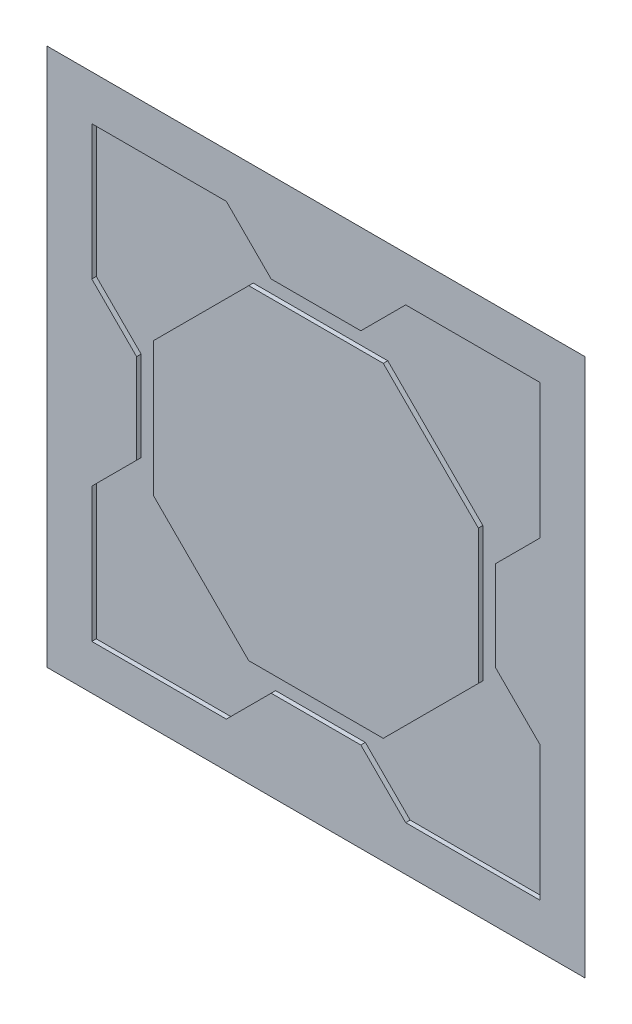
ISO-10303-21;
HEADER;
FILE_DESCRIPTION(('STEP AP214'),'2;1');
FILE_NAME('part.step','',(''),(''),'','','');
FILE_SCHEMA(('AUTOMOTIVE_DESIGN { 1 0 10303 214 1 1 1 1 }'));
ENDSEC;
DATA;
#1=APPLICATION_CONTEXT('core data for automotive mechanical design processes');
#2=APPLICATION_PROTOCOL_DEFINITION('international standard','automotive_design',2000,#1);
#3=PRODUCT_CONTEXT('',#1,'mechanical');
#4=PRODUCT('Part','Part','',(#3));
#5=PRODUCT_RELATED_PRODUCT_CATEGORY('part','',(#4));
#6=PRODUCT_DEFINITION_FORMATION('','',#4);
#7=PRODUCT_DEFINITION_CONTEXT('part definition',#1,'design');
#8=PRODUCT_DEFINITION('design','',#6,#7);
#9=PRODUCT_DEFINITION_SHAPE('','',#8);
#10=(LENGTH_UNIT() NAMED_UNIT(*) SI_UNIT(.MILLI.,.METRE.));
#11=(NAMED_UNIT(*) PLANE_ANGLE_UNIT() SI_UNIT($,.RADIAN.));
#12=(NAMED_UNIT(*) SI_UNIT($,.STERADIAN.) SOLID_ANGLE_UNIT());
#13=UNCERTAINTY_MEASURE_WITH_UNIT(LENGTH_MEASURE(1.E-05),#10,'distance_accuracy_value','');
#14=(GEOMETRIC_REPRESENTATION_CONTEXT(3) GLOBAL_UNCERTAINTY_ASSIGNED_CONTEXT((#13)) GLOBAL_UNIT_ASSIGNED_CONTEXT((#10,
#11,#12)) REPRESENTATION_CONTEXT('',''));
#15=CARTESIAN_POINT('',(0.,0.,0.));
#16=DIRECTION('',(0.,0.,1.));
#17=DIRECTION('',(1.,0.,0.));
#18=AXIS2_PLACEMENT_3D('',#15,#16,#17);
#19=CARTESIAN_POINT('',(0.,0.,10.));
#20=DIRECTION('',(0.,0.,-1.));
#21=DIRECTION('',(-1.,0.,0.));
#22=AXIS2_PLACEMENT_3D('',#19,#20,#21);
#23=PLANE('',#22);
#24=DIRECTION('',(0.707106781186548,-0.707106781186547,0.));
#25=VECTOR('',#24,1.);
#26=CARTESIAN_POINT('',(-50.,20.,10.));
#27=LINE('',#26,#25);
#28=CARTESIAN_POINT('',(-50.,20.,10.));
#29=VERTEX_POINT('',#28);
#30=CARTESIAN_POINT('',(-40.,10.,10.));
#31=VERTEX_POINT('',#30);
#32=EDGE_CURVE('E383',#29,#31,#27,.T.);
#33=ORIENTED_EDGE('',*,*,#32,.F.);
#34=DIRECTION('',(0.,-1.,0.));
#35=VECTOR('',#34,1.);
#36=CARTESIAN_POINT('',(-50.,50.,10.));
#37=LINE('',#36,#35);
#38=CARTESIAN_POINT('',(-50.,50.,10.));
#39=VERTEX_POINT('',#38);
#40=EDGE_CURVE('E308',#39,#29,#37,.T.);
#41=ORIENTED_EDGE('',*,*,#40,.F.);
#42=DIRECTION('',(-1.,0.,0.));
#43=VECTOR('',#42,1.);
#44=CARTESIAN_POINT('',(-50.,50.,10.));
#45=LINE('',#44,#43);
#46=CARTESIAN_POINT('',(-20.,50.,10.));
#47=VERTEX_POINT('',#46);
#48=EDGE_CURVE('E324',#47,#39,#45,.T.);
#49=ORIENTED_EDGE('',*,*,#48,.F.);
#50=DIRECTION('',(-0.707106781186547,0.707106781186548,0.));
#51=VECTOR('',#50,1.);
#52=CARTESIAN_POINT('',(-20.,50.,10.));
#53=LINE('',#52,#51);
#54=CARTESIAN_POINT('',(-10.,40.,10.));
#55=VERTEX_POINT('',#54);
#56=EDGE_CURVE('E434',#55,#47,#53,.T.);
#57=ORIENTED_EDGE('',*,*,#56,.F.);
#58=DIRECTION('',(-1.,0.,0.));
#59=VECTOR('',#58,1.);
#60=CARTESIAN_POINT('',(-10.,40.,10.));
#61=LINE('',#60,#59);
#62=CARTESIAN_POINT('',(9.99999999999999,40.,10.));
#63=VERTEX_POINT('',#62);
#64=EDGE_CURVE('E431',#63,#55,#61,.T.);
#65=ORIENTED_EDGE('',*,*,#64,.F.);
#66=DIRECTION('',(-0.707106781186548,-0.707106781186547,0.));
#67=VECTOR('',#66,1.);
#68=CARTESIAN_POINT('',(9.99999999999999,40.,10.));
#69=LINE('',#68,#67);
#70=CARTESIAN_POINT('',(20.,50.,10.));
#71=VERTEX_POINT('',#70);
#72=EDGE_CURVE('E428',#71,#63,#69,.T.);
#73=ORIENTED_EDGE('',*,*,#72,.F.);
#74=DIRECTION('',(-1.,0.,0.));
#75=VECTOR('',#74,1.);
#76=CARTESIAN_POINT('',(20.,50.,10.));
#77=LINE('',#76,#75);
#78=CARTESIAN_POINT('',(50.,50.,10.));
#79=VERTEX_POINT('',#78);
#80=EDGE_CURVE('E425',#79,#71,#77,.T.);
#81=ORIENTED_EDGE('',*,*,#80,.F.);
#82=DIRECTION('',(0.,1.,0.));
#83=VECTOR('',#82,1.);
#84=CARTESIAN_POINT('',(50.,20.,10.));
#85=LINE('',#84,#83);
#86=CARTESIAN_POINT('',(50.,20.,10.));
#87=VERTEX_POINT('',#86);
#88=EDGE_CURVE('E422',#87,#79,#85,.T.);
#89=ORIENTED_EDGE('',*,*,#88,.F.);
#90=DIRECTION('',(0.707106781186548,0.707106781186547,0.));
#91=VECTOR('',#90,1.);
#92=CARTESIAN_POINT('',(40.,10.,10.));
#93=LINE('',#92,#91);
#94=CARTESIAN_POINT('',(40.,10.,10.));
#95=VERTEX_POINT('',#94);
#96=EDGE_CURVE('E419',#95,#87,#93,.T.);
#97=ORIENTED_EDGE('',*,*,#96,.F.);
#98=DIRECTION('',(0.,1.,0.));
#99=VECTOR('',#98,1.);
#100=CARTESIAN_POINT('',(40.,-10.,10.));
#101=LINE('',#100,#99);
#102=CARTESIAN_POINT('',(40.,-10.,10.));
#103=VERTEX_POINT('',#102);
#104=EDGE_CURVE('E416',#103,#95,#101,.T.);
#105=ORIENTED_EDGE('',*,*,#104,.F.);
#106=DIRECTION('',(-0.707106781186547,0.707106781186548,0.));
#107=VECTOR('',#106,1.);
#108=CARTESIAN_POINT('',(50.,-20.,10.));
#109=LINE('',#108,#107);
#110=CARTESIAN_POINT('',(50.,-20.,10.));
#111=VERTEX_POINT('',#110);
#112=EDGE_CURVE('E413',#111,#103,#109,.T.);
#113=ORIENTED_EDGE('',*,*,#112,.F.);
#114=DIRECTION('',(0.,1.,0.));
#115=VECTOR('',#114,1.);
#116=CARTESIAN_POINT('',(50.,-50.,10.));
#117=LINE('',#116,#115);
#118=CARTESIAN_POINT('',(50.,-50.,10.));
#119=VERTEX_POINT('',#118);
#120=EDGE_CURVE('E410',#119,#111,#117,.T.);
#121=ORIENTED_EDGE('',*,*,#120,.F.);
#122=DIRECTION('',(1.,0.,0.));
#123=VECTOR('',#122,1.);
#124=CARTESIAN_POINT('',(20.,-50.,10.));
#125=LINE('',#124,#123);
#126=CARTESIAN_POINT('',(20.,-50.,10.));
#127=VERTEX_POINT('',#126);
#128=EDGE_CURVE('E407',#127,#119,#125,.T.);
#129=ORIENTED_EDGE('',*,*,#128,.F.);
#130=DIRECTION('',(0.707106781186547,-0.707106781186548,0.));
#131=VECTOR('',#130,1.);
#132=CARTESIAN_POINT('',(9.99999999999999,-40.,10.));
#133=LINE('',#132,#131);
#134=CARTESIAN_POINT('',(9.99999999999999,-40.,10.));
#135=VERTEX_POINT('',#134);
#136=EDGE_CURVE('E404',#135,#127,#133,.T.);
#137=ORIENTED_EDGE('',*,*,#136,.F.);
#138=DIRECTION('',(1.,0.,0.));
#139=VECTOR('',#138,1.);
#140=CARTESIAN_POINT('',(-10.,-40.,10.));
#141=LINE('',#140,#139);
#142=CARTESIAN_POINT('',(-10.,-40.,10.));
#143=VERTEX_POINT('',#142);
#144=EDGE_CURVE('E401',#143,#135,#141,.T.);
#145=ORIENTED_EDGE('',*,*,#144,.F.);
#146=DIRECTION('',(0.707106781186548,0.707106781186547,0.));
#147=VECTOR('',#146,1.);
#148=CARTESIAN_POINT('',(-20.,-50.,10.));
#149=LINE('',#148,#147);
#150=CARTESIAN_POINT('',(-20.,-50.,10.));
#151=VERTEX_POINT('',#150);
#152=EDGE_CURVE('E398',#151,#143,#149,.T.);
#153=ORIENTED_EDGE('',*,*,#152,.F.);
#154=DIRECTION('',(1.,0.,0.));
#155=VECTOR('',#154,1.);
#156=CARTESIAN_POINT('',(-50.,-50.,10.));
#157=LINE('',#156,#155);
#158=CARTESIAN_POINT('',(-50.,-50.,10.));
#159=VERTEX_POINT('',#158);
#160=EDGE_CURVE('E395',#159,#151,#157,.T.);
#161=ORIENTED_EDGE('',*,*,#160,.F.);
#162=DIRECTION('',(0.,-1.,0.));
#163=VECTOR('',#162,1.);
#164=CARTESIAN_POINT('',(-50.,-20.,10.));
#165=LINE('',#164,#163);
#166=CARTESIAN_POINT('',(-50.,-20.,10.));
#167=VERTEX_POINT('',#166);
#168=EDGE_CURVE('E392',#167,#159,#165,.T.);
#169=ORIENTED_EDGE('',*,*,#168,.F.);
#170=DIRECTION('',(-0.707106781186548,-0.707106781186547,0.));
#171=VECTOR('',#170,1.);
#172=CARTESIAN_POINT('',(-40.,-10.,10.));
#173=LINE('',#172,#171);
#174=CARTESIAN_POINT('',(-40.,-10.,10.));
#175=VERTEX_POINT('',#174);
#176=EDGE_CURVE('E389',#175,#167,#173,.T.);
#177=ORIENTED_EDGE('',*,*,#176,.F.);
#178=DIRECTION('',(0.,-1.,0.));
#179=VECTOR('',#178,1.);
#180=CARTESIAN_POINT('',(-40.,10.,10.));
#181=LINE('',#180,#179);
#182=EDGE_CURVE('E386',#31,#175,#181,.T.);
#183=ORIENTED_EDGE('',*,*,#182,.F.);
#184=EDGE_LOOP('',(#33,#41,#49,#57,#65,#73,#81,#89,#97,#105,#113,#121,#129,#137,#145,#153,#161,
#169,#177,#183));
#185=FACE_BOUND('',#184,.T.);
#186=DIRECTION('',(0.,1.,0.));
#187=VECTOR('',#186,1.);
#188=CARTESIAN_POINT('',(60.,-60.,10.));
#189=LINE('',#188,#187);
#190=CARTESIAN_POINT('',(60.,-60.,10.));
#191=VERTEX_POINT('',#190);
#192=CARTESIAN_POINT('',(60.,60.,10.));
#193=VERTEX_POINT('',#192);
#194=EDGE_CURVE('E441',#191,#193,#189,.T.);
#195=ORIENTED_EDGE('',*,*,#194,.T.);
#196=DIRECTION('',(-1.,0.,0.));
#197=VECTOR('',#196,1.);
#198=CARTESIAN_POINT('',(-60.,60.,10.));
#199=LINE('',#198,#197);
#200=CARTESIAN_POINT('',(-60.,60.,10.));
#201=VERTEX_POINT('',#200);
#202=EDGE_CURVE('E481',#193,#201,#199,.T.);
#203=ORIENTED_EDGE('',*,*,#202,.T.);
#204=DIRECTION('',(0.,-1.,0.));
#205=VECTOR('',#204,1.);
#206=CARTESIAN_POINT('',(-60.,-60.,10.));
#207=LINE('',#206,#205);
#208=CARTESIAN_POINT('',(-60.,-60.,10.));
#209=VERTEX_POINT('',#208);
#210=EDGE_CURVE('E483',#201,#209,#207,.T.);
#211=ORIENTED_EDGE('',*,*,#210,.T.);
#212=DIRECTION('',(1.,0.,0.));
#213=VECTOR('',#212,1.);
#214=CARTESIAN_POINT('',(-60.,-60.,10.));
#215=LINE('',#214,#213);
#216=EDGE_CURVE('E486',#209,#191,#215,.T.);
#217=ORIENTED_EDGE('',*,*,#216,.T.);
#218=EDGE_LOOP('',(#195,#203,#211,#217));
#219=FACE_BOUND('',#218,.T.);
#220=ADVANCED_FACE('F33',(#185,#219),#23,.F.);
#221=CARTESIAN_POINT('',(0.,0.,0.));
#222=DIRECTION('',(0.,0.,-1.));
#223=DIRECTION('',(-1.,0.,0.));
#224=AXIS2_PLACEMENT_3D('',#221,#222,#223);
#225=PLANE('',#224);
#226=DIRECTION('',(-1.,0.,0.));
#227=VECTOR('',#226,1.);
#228=CARTESIAN_POINT('',(-60.,-50.,0.));
#229=LINE('',#228,#227);
#230=CARTESIAN_POINT('',(50.,-50.,0.));
#231=VERTEX_POINT('',#230);
#232=CARTESIAN_POINT('',(-50.,-50.,0.));
#233=VERTEX_POINT('',#232);
#234=EDGE_CURVE('E42',#231,#233,#229,.T.);
#235=ORIENTED_EDGE('',*,*,#234,.T.);
#236=DIRECTION('',(0.,1.,0.));
#237=VECTOR('',#236,1.);
#238=CARTESIAN_POINT('',(-50.,60.,0.));
#239=LINE('',#238,#237);
#240=CARTESIAN_POINT('',(-50.,50.,0.));
#241=VERTEX_POINT('',#240);
#242=EDGE_CURVE('E11',#233,#241,#239,.T.);
#243=ORIENTED_EDGE('',*,*,#242,.T.);
#244=DIRECTION('',(1.,0.,0.));
#245=VECTOR('',#244,1.);
#246=CARTESIAN_POINT('',(60.,50.,0.));
#247=LINE('',#246,#245);
#248=CARTESIAN_POINT('',(50.,50.,0.));
#249=VERTEX_POINT('',#248);
#250=EDGE_CURVE('E488',#241,#249,#247,.T.);
#251=ORIENTED_EDGE('',*,*,#250,.T.);
#252=DIRECTION('',(0.,-1.,0.));
#253=VECTOR('',#252,1.);
#254=CARTESIAN_POINT('',(50.,-60.,0.));
#255=LINE('',#254,#253);
#256=EDGE_CURVE('E53',#249,#231,#255,.T.);
#257=ORIENTED_EDGE('',*,*,#256,.T.);
#258=EDGE_LOOP('',(#235,#243,#251,#257));
#259=FACE_BOUND('',#258,.T.);
#260=ADVANCED_FACE('F513',(#259),#225,.T.);
#261=CARTESIAN_POINT('',(-50.,50.,9.));
#262=DIRECTION('',(-1.,0.,0.));
#263=DIRECTION('',(0.,0.,1.));
#264=AXIS2_PLACEMENT_3D('',#261,#262,#263);
#265=PLANE('',#264);
#266=ORIENTED_EDGE('',*,*,#40,.T.);
#267=DIRECTION('',(0.,0.,1.));
#268=VECTOR('',#267,1.);
#269=CARTESIAN_POINT('',(-50.,20.,9.));
#270=LINE('',#269,#268);
#271=CARTESIAN_POINT('',(-50.,20.,9.));
#272=VERTEX_POINT('',#271);
#273=EDGE_CURVE('E381',#272,#29,#270,.T.);
#274=ORIENTED_EDGE('',*,*,#273,.F.);
#275=DIRECTION('',(0.,-1.,0.));
#276=VECTOR('',#275,1.);
#277=CARTESIAN_POINT('',(-50.,50.,9.));
#278=LINE('',#277,#276);
#279=CARTESIAN_POINT('',(-50.,50.,9.));
#280=VERTEX_POINT('',#279);
#281=EDGE_CURVE('E320',#280,#272,#278,.T.);
#282=ORIENTED_EDGE('',*,*,#281,.F.);
#283=DIRECTION('',(0.,0.,1.));
#284=VECTOR('',#283,1.);
#285=CARTESIAN_POINT('',(-50.,50.,9.));
#286=LINE('',#285,#284);
#287=EDGE_CURVE('E439',#280,#39,#286,.T.);
#288=ORIENTED_EDGE('',*,*,#287,.T.);
#289=EDGE_LOOP('',(#266,#274,#282,#288));
#290=FACE_BOUND('',#289,.T.);
#291=ADVANCED_FACE('F515',(#290),#265,.F.);
#292=CARTESIAN_POINT('',(-50.,50.,9.));
#293=DIRECTION('',(0.,1.,0.));
#294=DIRECTION('',(0.,0.,1.));
#295=AXIS2_PLACEMENT_3D('',#292,#293,#294);
#296=PLANE('',#295);
#297=ORIENTED_EDGE('',*,*,#48,.T.);
#298=ORIENTED_EDGE('',*,*,#287,.F.);
#299=DIRECTION('',(-1.,0.,0.));
#300=VECTOR('',#299,1.);
#301=CARTESIAN_POINT('',(-50.,50.,9.));
#302=LINE('',#301,#300);
#303=CARTESIAN_POINT('',(-20.,50.,9.));
#304=VERTEX_POINT('',#303);
#305=EDGE_CURVE('E378',#304,#280,#302,.T.);
#306=ORIENTED_EDGE('',*,*,#305,.F.);
#307=DIRECTION('',(0.,0.,1.));
#308=VECTOR('',#307,1.);
#309=CARTESIAN_POINT('',(-20.,50.,9.));
#310=LINE('',#309,#308);
#311=EDGE_CURVE('E442',#304,#47,#310,.T.);
#312=ORIENTED_EDGE('',*,*,#311,.T.);
#313=EDGE_LOOP('',(#297,#298,#306,#312));
#314=FACE_BOUND('',#313,.T.);
#315=ADVANCED_FACE('F521',(#314),#296,.F.);
#316=CARTESIAN_POINT('',(-20.,50.,9.));
#317=DIRECTION('',(0.707106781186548,0.707106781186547,0.));
#318=DIRECTION('',(-0.707106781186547,0.707106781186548,0.));
#319=AXIS2_PLACEMENT_3D('',#316,#317,#318);
#320=PLANE('',#319);
#321=ORIENTED_EDGE('',*,*,#56,.T.);
#322=ORIENTED_EDGE('',*,*,#311,.F.);
#323=DIRECTION('',(-0.707106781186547,0.707106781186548,0.));
#324=VECTOR('',#323,1.);
#325=CARTESIAN_POINT('',(-20.,50.,9.));
#326=LINE('',#325,#324);
#327=CARTESIAN_POINT('',(-10.,40.,9.));
#328=VERTEX_POINT('',#327);
#329=EDGE_CURVE('E375',#328,#304,#326,.T.);
#330=ORIENTED_EDGE('',*,*,#329,.F.);
#331=DIRECTION('',(0.,0.,1.));
#332=VECTOR('',#331,1.);
#333=CARTESIAN_POINT('',(-10.,40.,9.));
#334=LINE('',#333,#332);
#335=EDGE_CURVE('E444',#328,#55,#334,.T.);
#336=ORIENTED_EDGE('',*,*,#335,.T.);
#337=EDGE_LOOP('',(#321,#322,#330,#336));
#338=FACE_BOUND('',#337,.T.);
#339=ADVANCED_FACE('F578',(#338),#320,.F.);
#340=CARTESIAN_POINT('',(-10.,40.,9.));
#341=DIRECTION('',(0.,1.,0.));
#342=DIRECTION('',(-1.,0.,0.));
#343=AXIS2_PLACEMENT_3D('',#340,#341,#342);
#344=PLANE('',#343);
#345=ORIENTED_EDGE('',*,*,#64,.T.);
#346=ORIENTED_EDGE('',*,*,#335,.F.);
#347=DIRECTION('',(-1.,0.,0.));
#348=VECTOR('',#347,1.);
#349=CARTESIAN_POINT('',(-10.,40.,9.));
#350=LINE('',#349,#348);
#351=CARTESIAN_POINT('',(9.99999999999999,40.,9.));
#352=VERTEX_POINT('',#351);
#353=EDGE_CURVE('E372',#352,#328,#350,.T.);
#354=ORIENTED_EDGE('',*,*,#353,.F.);
#355=DIRECTION('',(0.,0.,1.));
#356=VECTOR('',#355,1.);
#357=CARTESIAN_POINT('',(9.99999999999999,40.,9.));
#358=LINE('',#357,#356);
#359=EDGE_CURVE('E446',#352,#63,#358,.T.);
#360=ORIENTED_EDGE('',*,*,#359,.T.);
#361=EDGE_LOOP('',(#345,#346,#354,#360));
#362=FACE_BOUND('',#361,.T.);
#363=ADVANCED_FACE('F582',(#362),#344,.F.);
#364=CARTESIAN_POINT('',(9.99999999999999,40.,9.));
#365=DIRECTION('',(-0.707106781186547,0.707106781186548,0.));
#366=DIRECTION('',(-0.707106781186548,-0.707106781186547,0.));
#367=AXIS2_PLACEMENT_3D('',#364,#365,#366);
#368=PLANE('',#367);
#369=ORIENTED_EDGE('',*,*,#72,.T.);
#370=ORIENTED_EDGE('',*,*,#359,.F.);
#371=DIRECTION('',(-0.707106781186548,-0.707106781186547,0.));
#372=VECTOR('',#371,1.);
#373=CARTESIAN_POINT('',(9.99999999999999,40.,9.));
#374=LINE('',#373,#372);
#375=CARTESIAN_POINT('',(20.,50.,9.));
#376=VERTEX_POINT('',#375);
#377=EDGE_CURVE('E369',#376,#352,#374,.T.);
#378=ORIENTED_EDGE('',*,*,#377,.F.);
#379=DIRECTION('',(0.,0.,1.));
#380=VECTOR('',#379,1.);
#381=CARTESIAN_POINT('',(20.,50.,9.));
#382=LINE('',#381,#380);
#383=EDGE_CURVE('E448',#376,#71,#382,.T.);
#384=ORIENTED_EDGE('',*,*,#383,.T.);
#385=EDGE_LOOP('',(#369,#370,#378,#384));
#386=FACE_BOUND('',#385,.T.);
#387=ADVANCED_FACE('F586',(#386),#368,.F.);
#388=CARTESIAN_POINT('',(20.,50.,9.));
#389=DIRECTION('',(0.,1.,0.));
#390=DIRECTION('',(-1.,0.,0.));
#391=AXIS2_PLACEMENT_3D('',#388,#389,#390);
#392=PLANE('',#391);
#393=ORIENTED_EDGE('',*,*,#80,.T.);
#394=ORIENTED_EDGE('',*,*,#383,.F.);
#395=DIRECTION('',(-1.,0.,0.));
#396=VECTOR('',#395,1.);
#397=CARTESIAN_POINT('',(20.,50.,9.));
#398=LINE('',#397,#396);
#399=CARTESIAN_POINT('',(50.,50.,9.));
#400=VERTEX_POINT('',#399);
#401=EDGE_CURVE('E366',#400,#376,#398,.T.);
#402=ORIENTED_EDGE('',*,*,#401,.F.);
#403=DIRECTION('',(0.,0.,1.));
#404=VECTOR('',#403,1.);
#405=CARTESIAN_POINT('',(50.,50.,9.));
#406=LINE('',#405,#404);
#407=EDGE_CURVE('E450',#400,#79,#406,.T.);
#408=ORIENTED_EDGE('',*,*,#407,.T.);
#409=EDGE_LOOP('',(#393,#394,#402,#408));
#410=FACE_BOUND('',#409,.T.);
#411=ADVANCED_FACE('F590',(#410),#392,.F.);
#412=CARTESIAN_POINT('',(50.,20.,9.));
#413=DIRECTION('',(1.,0.,0.));
#414=DIRECTION('',(0.,0.,-1.));
#415=AXIS2_PLACEMENT_3D('',#412,#413,#414);
#416=PLANE('',#415);
#417=ORIENTED_EDGE('',*,*,#88,.T.);
#418=ORIENTED_EDGE('',*,*,#407,.F.);
#419=DIRECTION('',(0.,1.,0.));
#420=VECTOR('',#419,1.);
#421=CARTESIAN_POINT('',(50.,20.,9.));
#422=LINE('',#421,#420);
#423=CARTESIAN_POINT('',(50.,20.,9.));
#424=VERTEX_POINT('',#423);
#425=EDGE_CURVE('E363',#424,#400,#422,.T.);
#426=ORIENTED_EDGE('',*,*,#425,.F.);
#427=DIRECTION('',(0.,0.,1.));
#428=VECTOR('',#427,1.);
#429=CARTESIAN_POINT('',(50.,20.,9.));
#430=LINE('',#429,#428);
#431=EDGE_CURVE('E452',#424,#87,#430,.T.);
#432=ORIENTED_EDGE('',*,*,#431,.T.);
#433=EDGE_LOOP('',(#417,#418,#426,#432));
#434=FACE_BOUND('',#433,.T.);
#435=ADVANCED_FACE('F594',(#434),#416,.F.);
#436=CARTESIAN_POINT('',(40.,10.,9.));
#437=DIRECTION('',(0.707106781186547,-0.707106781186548,0.));
#438=DIRECTION('',(0.707106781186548,0.707106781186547,0.));
#439=AXIS2_PLACEMENT_3D('',#436,#437,#438);
#440=PLANE('',#439);
#441=ORIENTED_EDGE('',*,*,#96,.T.);
#442=ORIENTED_EDGE('',*,*,#431,.F.);
#443=DIRECTION('',(0.707106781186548,0.707106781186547,0.));
#444=VECTOR('',#443,1.);
#445=CARTESIAN_POINT('',(40.,10.,9.));
#446=LINE('',#445,#444);
#447=CARTESIAN_POINT('',(40.,10.,9.));
#448=VERTEX_POINT('',#447);
#449=EDGE_CURVE('E360',#448,#424,#446,.T.);
#450=ORIENTED_EDGE('',*,*,#449,.F.);
#451=DIRECTION('',(0.,0.,1.));
#452=VECTOR('',#451,1.);
#453=CARTESIAN_POINT('',(40.,10.,9.));
#454=LINE('',#453,#452);
#455=EDGE_CURVE('E454',#448,#95,#454,.T.);
#456=ORIENTED_EDGE('',*,*,#455,.T.);
#457=EDGE_LOOP('',(#441,#442,#450,#456));
#458=FACE_BOUND('',#457,.T.);
#459=ADVANCED_FACE('F598',(#458),#440,.F.);
#460=CARTESIAN_POINT('',(40.,-10.,9.));
#461=DIRECTION('',(1.,0.,0.));
#462=DIRECTION('',(0.,0.,-1.));
#463=AXIS2_PLACEMENT_3D('',#460,#461,#462);
#464=PLANE('',#463);
#465=ORIENTED_EDGE('',*,*,#104,.T.);
#466=ORIENTED_EDGE('',*,*,#455,.F.);
#467=DIRECTION('',(0.,1.,0.));
#468=VECTOR('',#467,1.);
#469=CARTESIAN_POINT('',(40.,-10.,9.));
#470=LINE('',#469,#468);
#471=CARTESIAN_POINT('',(40.,-10.,9.));
#472=VERTEX_POINT('',#471);
#473=EDGE_CURVE('E357',#472,#448,#470,.T.);
#474=ORIENTED_EDGE('',*,*,#473,.F.);
#475=DIRECTION('',(0.,0.,1.));
#476=VECTOR('',#475,1.);
#477=CARTESIAN_POINT('',(40.,-10.,9.));
#478=LINE('',#477,#476);
#479=EDGE_CURVE('E456',#472,#103,#478,.T.);
#480=ORIENTED_EDGE('',*,*,#479,.T.);
#481=EDGE_LOOP('',(#465,#466,#474,#480));
#482=FACE_BOUND('',#481,.T.);
#483=ADVANCED_FACE('F602',(#482),#464,.F.);
#484=CARTESIAN_POINT('',(50.,-20.,9.));
#485=DIRECTION('',(0.707106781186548,0.707106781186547,0.));
#486=DIRECTION('',(-0.707106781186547,0.707106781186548,0.));
#487=AXIS2_PLACEMENT_3D('',#484,#485,#486);
#488=PLANE('',#487);
#489=ORIENTED_EDGE('',*,*,#112,.T.);
#490=ORIENTED_EDGE('',*,*,#479,.F.);
#491=DIRECTION('',(-0.707106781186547,0.707106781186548,0.));
#492=VECTOR('',#491,1.);
#493=CARTESIAN_POINT('',(50.,-20.,9.));
#494=LINE('',#493,#492);
#495=CARTESIAN_POINT('',(50.,-20.,9.));
#496=VERTEX_POINT('',#495);
#497=EDGE_CURVE('E354',#496,#472,#494,.T.);
#498=ORIENTED_EDGE('',*,*,#497,.F.);
#499=DIRECTION('',(0.,0.,1.));
#500=VECTOR('',#499,1.);
#501=CARTESIAN_POINT('',(50.,-20.,9.));
#502=LINE('',#501,#500);
#503=EDGE_CURVE('E458',#496,#111,#502,.T.);
#504=ORIENTED_EDGE('',*,*,#503,.T.);
#505=EDGE_LOOP('',(#489,#490,#498,#504));
#506=FACE_BOUND('',#505,.T.);
#507=ADVANCED_FACE('F606',(#506),#488,.F.);
#508=CARTESIAN_POINT('',(50.,-50.,9.));
#509=DIRECTION('',(1.,0.,0.));
#510=DIRECTION('',(0.,0.,-1.));
#511=AXIS2_PLACEMENT_3D('',#508,#509,#510);
#512=PLANE('',#511);
#513=ORIENTED_EDGE('',*,*,#120,.T.);
#514=ORIENTED_EDGE('',*,*,#503,.F.);
#515=DIRECTION('',(0.,1.,0.));
#516=VECTOR('',#515,1.);
#517=CARTESIAN_POINT('',(50.,-50.,9.));
#518=LINE('',#517,#516);
#519=CARTESIAN_POINT('',(50.,-50.,9.));
#520=VERTEX_POINT('',#519);
#521=EDGE_CURVE('E351',#520,#496,#518,.T.);
#522=ORIENTED_EDGE('',*,*,#521,.F.);
#523=DIRECTION('',(0.,0.,1.));
#524=VECTOR('',#523,1.);
#525=CARTESIAN_POINT('',(50.,-50.,9.));
#526=LINE('',#525,#524);
#527=EDGE_CURVE('E460',#520,#119,#526,.T.);
#528=ORIENTED_EDGE('',*,*,#527,.T.);
#529=EDGE_LOOP('',(#513,#514,#522,#528));
#530=FACE_BOUND('',#529,.T.);
#531=ADVANCED_FACE('F610',(#530),#512,.F.);
#532=CARTESIAN_POINT('',(20.,-50.,9.));
#533=DIRECTION('',(0.,-1.,0.));
#534=DIRECTION('',(0.,0.,-1.));
#535=AXIS2_PLACEMENT_3D('',#532,#533,#534);
#536=PLANE('',#535);
#537=ORIENTED_EDGE('',*,*,#128,.T.);
#538=ORIENTED_EDGE('',*,*,#527,.F.);
#539=DIRECTION('',(1.,0.,0.));
#540=VECTOR('',#539,1.);
#541=CARTESIAN_POINT('',(20.,-50.,9.));
#542=LINE('',#541,#540);
#543=CARTESIAN_POINT('',(20.,-50.,9.));
#544=VERTEX_POINT('',#543);
#545=EDGE_CURVE('E348',#544,#520,#542,.T.);
#546=ORIENTED_EDGE('',*,*,#545,.F.);
#547=DIRECTION('',(0.,0.,1.));
#548=VECTOR('',#547,1.);
#549=CARTESIAN_POINT('',(20.,-50.,9.));
#550=LINE('',#549,#548);
#551=EDGE_CURVE('E462',#544,#127,#550,.T.);
#552=ORIENTED_EDGE('',*,*,#551,.T.);
#553=EDGE_LOOP('',(#537,#538,#546,#552));
#554=FACE_BOUND('',#553,.T.);
#555=ADVANCED_FACE('F614',(#554),#536,.F.);
#556=CARTESIAN_POINT('',(9.99999999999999,-40.,9.));
#557=DIRECTION('',(-0.707106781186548,-0.707106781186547,0.));
#558=DIRECTION('',(0.707106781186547,-0.707106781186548,0.));
#559=AXIS2_PLACEMENT_3D('',#556,#557,#558);
#560=PLANE('',#559);
#561=ORIENTED_EDGE('',*,*,#136,.T.);
#562=ORIENTED_EDGE('',*,*,#551,.F.);
#563=DIRECTION('',(0.707106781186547,-0.707106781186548,0.));
#564=VECTOR('',#563,1.);
#565=CARTESIAN_POINT('',(9.99999999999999,-40.,9.));
#566=LINE('',#565,#564);
#567=CARTESIAN_POINT('',(9.99999999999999,-40.,9.));
#568=VERTEX_POINT('',#567);
#569=EDGE_CURVE('E345',#568,#544,#566,.T.);
#570=ORIENTED_EDGE('',*,*,#569,.F.);
#571=DIRECTION('',(0.,0.,1.));
#572=VECTOR('',#571,1.);
#573=CARTESIAN_POINT('',(9.99999999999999,-40.,9.));
#574=LINE('',#573,#572);
#575=EDGE_CURVE('E464',#568,#135,#574,.T.);
#576=ORIENTED_EDGE('',*,*,#575,.T.);
#577=EDGE_LOOP('',(#561,#562,#570,#576));
#578=FACE_BOUND('',#577,.T.);
#579=ADVANCED_FACE('F618',(#578),#560,.F.);
#580=CARTESIAN_POINT('',(-10.,-40.,9.));
#581=DIRECTION('',(0.,-1.,0.));
#582=DIRECTION('',(0.,0.,-1.));
#583=AXIS2_PLACEMENT_3D('',#580,#581,#582);
#584=PLANE('',#583);
#585=ORIENTED_EDGE('',*,*,#144,.T.);
#586=ORIENTED_EDGE('',*,*,#575,.F.);
#587=DIRECTION('',(1.,0.,0.));
#588=VECTOR('',#587,1.);
#589=CARTESIAN_POINT('',(-10.,-40.,9.));
#590=LINE('',#589,#588);
#591=CARTESIAN_POINT('',(-10.,-40.,9.));
#592=VERTEX_POINT('',#591);
#593=EDGE_CURVE('E342',#592,#568,#590,.T.);
#594=ORIENTED_EDGE('',*,*,#593,.F.);
#595=DIRECTION('',(0.,0.,1.));
#596=VECTOR('',#595,1.);
#597=CARTESIAN_POINT('',(-10.,-40.,9.));
#598=LINE('',#597,#596);
#599=EDGE_CURVE('E466',#592,#143,#598,.T.);
#600=ORIENTED_EDGE('',*,*,#599,.T.);
#601=EDGE_LOOP('',(#585,#586,#594,#600));
#602=FACE_BOUND('',#601,.T.);
#603=ADVANCED_FACE('F622',(#602),#584,.F.);
#604=CARTESIAN_POINT('',(-20.,-50.,9.));
#605=DIRECTION('',(0.707106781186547,-0.707106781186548,0.));
#606=DIRECTION('',(0.707106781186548,0.707106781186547,0.));
#607=AXIS2_PLACEMENT_3D('',#604,#605,#606);
#608=PLANE('',#607);
#609=ORIENTED_EDGE('',*,*,#152,.T.);
#610=ORIENTED_EDGE('',*,*,#599,.F.);
#611=DIRECTION('',(0.707106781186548,0.707106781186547,0.));
#612=VECTOR('',#611,1.);
#613=CARTESIAN_POINT('',(-20.,-50.,9.));
#614=LINE('',#613,#612);
#615=CARTESIAN_POINT('',(-20.,-50.,9.));
#616=VERTEX_POINT('',#615);
#617=EDGE_CURVE('E339',#616,#592,#614,.T.);
#618=ORIENTED_EDGE('',*,*,#617,.F.);
#619=DIRECTION('',(0.,0.,1.));
#620=VECTOR('',#619,1.);
#621=CARTESIAN_POINT('',(-20.,-50.,9.));
#622=LINE('',#621,#620);
#623=EDGE_CURVE('E468',#616,#151,#622,.T.);
#624=ORIENTED_EDGE('',*,*,#623,.T.);
#625=EDGE_LOOP('',(#609,#610,#618,#624));
#626=FACE_BOUND('',#625,.T.);
#627=ADVANCED_FACE('F626',(#626),#608,.F.);
#628=CARTESIAN_POINT('',(-50.,-50.,9.));
#629=DIRECTION('',(0.,-1.,0.));
#630=DIRECTION('',(0.,0.,-1.));
#631=AXIS2_PLACEMENT_3D('',#628,#629,#630);
#632=PLANE('',#631);
#633=ORIENTED_EDGE('',*,*,#160,.T.);
#634=ORIENTED_EDGE('',*,*,#623,.F.);
#635=DIRECTION('',(1.,0.,0.));
#636=VECTOR('',#635,1.);
#637=CARTESIAN_POINT('',(-50.,-50.,9.));
#638=LINE('',#637,#636);
#639=CARTESIAN_POINT('',(-50.,-50.,9.));
#640=VERTEX_POINT('',#639);
#641=EDGE_CURVE('E336',#640,#616,#638,.T.);
#642=ORIENTED_EDGE('',*,*,#641,.F.);
#643=DIRECTION('',(0.,0.,1.));
#644=VECTOR('',#643,1.);
#645=CARTESIAN_POINT('',(-50.,-50.,9.));
#646=LINE('',#645,#644);
#647=EDGE_CURVE('E470',#640,#159,#646,.T.);
#648=ORIENTED_EDGE('',*,*,#647,.T.);
#649=EDGE_LOOP('',(#633,#634,#642,#648));
#650=FACE_BOUND('',#649,.T.);
#651=ADVANCED_FACE('F630',(#650),#632,.F.);
#652=CARTESIAN_POINT('',(-50.,-20.,9.));
#653=DIRECTION('',(-1.,0.,0.));
#654=DIRECTION('',(0.,0.,1.));
#655=AXIS2_PLACEMENT_3D('',#652,#653,#654);
#656=PLANE('',#655);
#657=ORIENTED_EDGE('',*,*,#168,.T.);
#658=ORIENTED_EDGE('',*,*,#647,.F.);
#659=DIRECTION('',(0.,-1.,0.));
#660=VECTOR('',#659,1.);
#661=CARTESIAN_POINT('',(-50.,-20.,9.));
#662=LINE('',#661,#660);
#663=CARTESIAN_POINT('',(-50.,-20.,9.));
#664=VERTEX_POINT('',#663);
#665=EDGE_CURVE('E333',#664,#640,#662,.T.);
#666=ORIENTED_EDGE('',*,*,#665,.F.);
#667=DIRECTION('',(0.,0.,1.));
#668=VECTOR('',#667,1.);
#669=CARTESIAN_POINT('',(-50.,-20.,9.));
#670=LINE('',#669,#668);
#671=EDGE_CURVE('E472',#664,#167,#670,.T.);
#672=ORIENTED_EDGE('',*,*,#671,.T.);
#673=EDGE_LOOP('',(#657,#658,#666,#672));
#674=FACE_BOUND('',#673,.T.);
#675=ADVANCED_FACE('F634',(#674),#656,.F.);
#676=CARTESIAN_POINT('',(-40.,-10.,9.));
#677=DIRECTION('',(-0.707106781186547,0.707106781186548,0.));
#678=DIRECTION('',(-0.707106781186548,-0.707106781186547,0.));
#679=AXIS2_PLACEMENT_3D('',#676,#677,#678);
#680=PLANE('',#679);
#681=ORIENTED_EDGE('',*,*,#176,.T.);
#682=ORIENTED_EDGE('',*,*,#671,.F.);
#683=DIRECTION('',(-0.707106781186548,-0.707106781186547,0.));
#684=VECTOR('',#683,1.);
#685=CARTESIAN_POINT('',(-40.,-10.,9.));
#686=LINE('',#685,#684);
#687=CARTESIAN_POINT('',(-40.,-10.,9.));
#688=VERTEX_POINT('',#687);
#689=EDGE_CURVE('E330',#688,#664,#686,.T.);
#690=ORIENTED_EDGE('',*,*,#689,.F.);
#691=DIRECTION('',(0.,0.,1.));
#692=VECTOR('',#691,1.);
#693=CARTESIAN_POINT('',(-40.,-10.,9.));
#694=LINE('',#693,#692);
#695=EDGE_CURVE('E474',#688,#175,#694,.T.);
#696=ORIENTED_EDGE('',*,*,#695,.T.);
#697=EDGE_LOOP('',(#681,#682,#690,#696));
#698=FACE_BOUND('',#697,.T.);
#699=ADVANCED_FACE('F638',(#698),#680,.F.);
#700=CARTESIAN_POINT('',(-40.,10.,9.));
#701=DIRECTION('',(-1.,0.,0.));
#702=DIRECTION('',(0.,0.,1.));
#703=AXIS2_PLACEMENT_3D('',#700,#701,#702);
#704=PLANE('',#703);
#705=ORIENTED_EDGE('',*,*,#182,.T.);
#706=ORIENTED_EDGE('',*,*,#695,.F.);
#707=DIRECTION('',(0.,-1.,0.));
#708=VECTOR('',#707,1.);
#709=CARTESIAN_POINT('',(-40.,10.,9.));
#710=LINE('',#709,#708);
#711=CARTESIAN_POINT('',(-40.,10.,9.));
#712=VERTEX_POINT('',#711);
#713=EDGE_CURVE('E327',#712,#688,#710,.T.);
#714=ORIENTED_EDGE('',*,*,#713,.F.);
#715=DIRECTION('',(0.,0.,1.));
#716=VECTOR('',#715,1.);
#717=CARTESIAN_POINT('',(-40.,10.,9.));
#718=LINE('',#717,#716);
#719=EDGE_CURVE('E476',#712,#31,#718,.T.);
#720=ORIENTED_EDGE('',*,*,#719,.T.);
#721=EDGE_LOOP('',(#705,#706,#714,#720));
#722=FACE_BOUND('',#721,.T.);
#723=ADVANCED_FACE('F642',(#722),#704,.F.);
#724=CARTESIAN_POINT('',(-50.,20.,9.));
#725=DIRECTION('',(-0.707106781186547,-0.707106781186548,0.));
#726=DIRECTION('',(0.707106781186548,-0.707106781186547,0.));
#727=AXIS2_PLACEMENT_3D('',#724,#725,#726);
#728=PLANE('',#727);
#729=ORIENTED_EDGE('',*,*,#32,.T.);
#730=ORIENTED_EDGE('',*,*,#719,.F.);
#731=DIRECTION('',(0.707106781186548,-0.707106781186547,0.));
#732=VECTOR('',#731,1.);
#733=CARTESIAN_POINT('',(-50.,20.,9.));
#734=LINE('',#733,#732);
#735=EDGE_CURVE('E323',#272,#712,#734,.T.);
#736=ORIENTED_EDGE('',*,*,#735,.F.);
#737=ORIENTED_EDGE('',*,*,#273,.T.);
#738=EDGE_LOOP('',(#729,#730,#736,#737));
#739=FACE_BOUND('',#738,.T.);
#740=ADVANCED_FACE('F575',(#739),#728,.F.);
#741=CARTESIAN_POINT('',(0.,0.,9.));
#742=DIRECTION('',(0.,0.,1.));
#743=DIRECTION('',(1.,0.,0.));
#744=AXIS2_PLACEMENT_3D('',#741,#742,#743);
#745=PLANE('',#744);
#746=DIRECTION('',(0.,1.,0.));
#747=VECTOR('',#746,1.);
#748=CARTESIAN_POINT('',(36.2132034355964,-15.,9.));
#749=LINE('',#748,#747);
#750=CARTESIAN_POINT('',(36.2132034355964,-15.,9.));
#751=VERTEX_POINT('',#750);
#752=CARTESIAN_POINT('',(36.2132034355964,15.,9.));
#753=VERTEX_POINT('',#752);
#754=EDGE_CURVE('E254',#751,#753,#749,.T.);
#755=ORIENTED_EDGE('',*,*,#754,.F.);
#756=DIRECTION('',(0.707106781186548,0.707106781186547,0.));
#757=VECTOR('',#756,1.);
#758=CARTESIAN_POINT('',(15.,-36.2132034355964,9.));
#759=LINE('',#758,#757);
#760=CARTESIAN_POINT('',(15.,-36.2132034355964,9.));
#761=VERTEX_POINT('',#760);
#762=EDGE_CURVE('E286',#761,#751,#759,.T.);
#763=ORIENTED_EDGE('',*,*,#762,.F.);
#764=DIRECTION('',(1.,0.,0.));
#765=VECTOR('',#764,1.);
#766=CARTESIAN_POINT('',(-15.,-36.2132034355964,9.));
#767=LINE('',#766,#765);
#768=CARTESIAN_POINT('',(-15.,-36.2132034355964,9.));
#769=VERTEX_POINT('',#768);
#770=EDGE_CURVE('E283',#769,#761,#767,.T.);
#771=ORIENTED_EDGE('',*,*,#770,.F.);
#772=DIRECTION('',(0.707106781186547,-0.707106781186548,0.));
#773=VECTOR('',#772,1.);
#774=CARTESIAN_POINT('',(-36.2132034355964,-15.,9.));
#775=LINE('',#774,#773);
#776=CARTESIAN_POINT('',(-36.2132034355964,-15.,9.));
#777=VERTEX_POINT('',#776);
#778=EDGE_CURVE('E280',#777,#769,#775,.T.);
#779=ORIENTED_EDGE('',*,*,#778,.F.);
#780=DIRECTION('',(0.,-1.,0.));
#781=VECTOR('',#780,1.);
#782=CARTESIAN_POINT('',(-36.2132034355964,15.,9.));
#783=LINE('',#782,#781);
#784=CARTESIAN_POINT('',(-36.2132034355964,15.,9.));
#785=VERTEX_POINT('',#784);
#786=EDGE_CURVE('E277',#785,#777,#783,.T.);
#787=ORIENTED_EDGE('',*,*,#786,.F.);
#788=DIRECTION('',(-0.707106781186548,-0.707106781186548,0.));
#789=VECTOR('',#788,1.);
#790=CARTESIAN_POINT('',(-15.,36.2132034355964,9.));
#791=LINE('',#790,#789);
#792=CARTESIAN_POINT('',(-15.,36.2132034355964,9.));
#793=VERTEX_POINT('',#792);
#794=EDGE_CURVE('E265',#793,#785,#791,.T.);
#795=ORIENTED_EDGE('',*,*,#794,.F.);
#796=DIRECTION('',(-1.,0.,0.));
#797=VECTOR('',#796,1.);
#798=CARTESIAN_POINT('',(15.,36.2132034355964,9.));
#799=LINE('',#798,#797);
#800=CARTESIAN_POINT('',(15.,36.2132034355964,9.));
#801=VERTEX_POINT('',#800);
#802=EDGE_CURVE('E246',#801,#793,#799,.T.);
#803=ORIENTED_EDGE('',*,*,#802,.F.);
#804=DIRECTION('',(-0.707106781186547,0.707106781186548,0.));
#805=VECTOR('',#804,1.);
#806=CARTESIAN_POINT('',(36.2132034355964,15.,9.));
#807=LINE('',#806,#805);
#808=EDGE_CURVE('E261',#753,#801,#807,.T.);
#809=ORIENTED_EDGE('',*,*,#808,.F.);
#810=EDGE_LOOP('',(#755,#763,#771,#779,#787,#795,#803,#809));
#811=FACE_BOUND('',#810,.T.);
#812=ORIENTED_EDGE('',*,*,#281,.T.);
#813=ORIENTED_EDGE('',*,*,#735,.T.);
#814=ORIENTED_EDGE('',*,*,#713,.T.);
#815=ORIENTED_EDGE('',*,*,#689,.T.);
#816=ORIENTED_EDGE('',*,*,#665,.T.);
#817=ORIENTED_EDGE('',*,*,#641,.T.);
#818=ORIENTED_EDGE('',*,*,#617,.T.);
#819=ORIENTED_EDGE('',*,*,#593,.T.);
#820=ORIENTED_EDGE('',*,*,#569,.T.);
#821=ORIENTED_EDGE('',*,*,#545,.T.);
#822=ORIENTED_EDGE('',*,*,#521,.T.);
#823=ORIENTED_EDGE('',*,*,#497,.T.);
#824=ORIENTED_EDGE('',*,*,#473,.T.);
#825=ORIENTED_EDGE('',*,*,#449,.T.);
#826=ORIENTED_EDGE('',*,*,#425,.T.);
#827=ORIENTED_EDGE('',*,*,#401,.T.);
#828=ORIENTED_EDGE('',*,*,#377,.T.);
#829=ORIENTED_EDGE('',*,*,#353,.T.);
#830=ORIENTED_EDGE('',*,*,#329,.T.);
#831=ORIENTED_EDGE('',*,*,#305,.T.);
#832=EDGE_LOOP('',(#812,#813,#814,#815,#816,#817,#818,#819,#820,#821,#822,#823,#824,#825,#826,
#827,#828,#829,#830,#831));
#833=FACE_BOUND('',#832,.T.);
#834=ADVANCED_FACE('F259',(#811,#833),#745,.T.);
#835=CARTESIAN_POINT('',(36.2132034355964,15.,9.));
#836=DIRECTION('',(0.707106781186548,0.707106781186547,0.));
#837=DIRECTION('',(-0.707106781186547,0.707106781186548,0.));
#838=AXIS2_PLACEMENT_3D('',#835,#836,#837);
#839=PLANE('',#838);
#840=DIRECTION('',(-0.707106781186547,0.707106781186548,0.));
#841=VECTOR('',#840,1.);
#842=CARTESIAN_POINT('',(36.2132034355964,15.,10.));
#843=LINE('',#842,#841);
#844=CARTESIAN_POINT('',(36.2132034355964,15.,10.));
#845=VERTEX_POINT('',#844);
#846=CARTESIAN_POINT('',(15.,36.2132034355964,10.));
#847=VERTEX_POINT('',#846);
#848=EDGE_CURVE('E290',#845,#847,#843,.T.);
#849=ORIENTED_EDGE('',*,*,#848,.F.);
#850=DIRECTION('',(0.,0.,1.));
#851=VECTOR('',#850,1.);
#852=CARTESIAN_POINT('',(36.2132034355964,15.,9.));
#853=LINE('',#852,#851);
#854=EDGE_CURVE('E269',#753,#845,#853,.T.);
#855=ORIENTED_EDGE('',*,*,#854,.F.);
#856=ORIENTED_EDGE('',*,*,#808,.T.);
#857=DIRECTION('',(0.,0.,1.));
#858=VECTOR('',#857,1.);
#859=CARTESIAN_POINT('',(15.,36.2132034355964,9.));
#860=LINE('',#859,#858);
#861=EDGE_CURVE('E242',#801,#847,#860,.T.);
#862=ORIENTED_EDGE('',*,*,#861,.T.);
#863=EDGE_LOOP('',(#849,#855,#856,#862));
#864=FACE_BOUND('',#863,.T.);
#865=ADVANCED_FACE('F268',(#864),#839,.T.);
#866=CARTESIAN_POINT('',(36.2132034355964,-15.,9.));
#867=DIRECTION('',(1.,0.,0.));
#868=DIRECTION('',(0.,0.,-1.));
#869=AXIS2_PLACEMENT_3D('',#866,#867,#868);
#870=PLANE('',#869);
#871=DIRECTION('',(0.,1.,0.));
#872=VECTOR('',#871,1.);
#873=CARTESIAN_POINT('',(36.2132034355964,-15.,10.));
#874=LINE('',#873,#872);
#875=CARTESIAN_POINT('',(36.2132034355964,-15.,10.));
#876=VERTEX_POINT('',#875);
#877=EDGE_CURVE('E270',#876,#845,#874,.T.);
#878=ORIENTED_EDGE('',*,*,#877,.F.);
#879=DIRECTION('',(0.,0.,1.));
#880=VECTOR('',#879,1.);
#881=CARTESIAN_POINT('',(36.2132034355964,-15.,9.));
#882=LINE('',#881,#880);
#883=EDGE_CURVE('E309',#751,#876,#882,.T.);
#884=ORIENTED_EDGE('',*,*,#883,.F.);
#885=ORIENTED_EDGE('',*,*,#754,.T.);
#886=ORIENTED_EDGE('',*,*,#854,.T.);
#887=EDGE_LOOP('',(#878,#884,#885,#886));
#888=FACE_BOUND('',#887,.T.);
#889=ADVANCED_FACE('F547',(#888),#870,.T.);
#890=CARTESIAN_POINT('',(15.,-36.2132034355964,9.));
#891=DIRECTION('',(0.707106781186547,-0.707106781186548,0.));
#892=DIRECTION('',(0.707106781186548,0.707106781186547,0.));
#893=AXIS2_PLACEMENT_3D('',#890,#891,#892);
#894=PLANE('',#893);
#895=DIRECTION('',(0.707106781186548,0.707106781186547,0.));
#896=VECTOR('',#895,1.);
#897=CARTESIAN_POINT('',(15.,-36.2132034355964,10.));
#898=LINE('',#897,#896);
#899=CARTESIAN_POINT('',(15.,-36.2132034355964,10.));
#900=VERTEX_POINT('',#899);
#901=EDGE_CURVE('E273',#900,#876,#898,.T.);
#902=ORIENTED_EDGE('',*,*,#901,.F.);
#903=DIRECTION('',(0.,0.,1.));
#904=VECTOR('',#903,1.);
#905=CARTESIAN_POINT('',(15.,-36.2132034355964,9.));
#906=LINE('',#905,#904);
#907=EDGE_CURVE('E311',#761,#900,#906,.T.);
#908=ORIENTED_EDGE('',*,*,#907,.F.);
#909=ORIENTED_EDGE('',*,*,#762,.T.);
#910=ORIENTED_EDGE('',*,*,#883,.T.);
#911=EDGE_LOOP('',(#902,#908,#909,#910));
#912=FACE_BOUND('',#911,.T.);
#913=ADVANCED_FACE('F551',(#912),#894,.T.);
#914=CARTESIAN_POINT('',(-15.,-36.2132034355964,9.));
#915=DIRECTION('',(0.,-1.,0.));
#916=DIRECTION('',(0.,0.,-1.));
#917=AXIS2_PLACEMENT_3D('',#914,#915,#916);
#918=PLANE('',#917);
#919=DIRECTION('',(1.,0.,0.));
#920=VECTOR('',#919,1.);
#921=CARTESIAN_POINT('',(-15.,-36.2132034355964,10.));
#922=LINE('',#921,#920);
#923=CARTESIAN_POINT('',(-15.,-36.2132034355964,10.));
#924=VERTEX_POINT('',#923);
#925=EDGE_CURVE('E302',#924,#900,#922,.T.);
#926=ORIENTED_EDGE('',*,*,#925,.F.);
#927=DIRECTION('',(0.,0.,1.));
#928=VECTOR('',#927,1.);
#929=CARTESIAN_POINT('',(-15.,-36.2132034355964,9.));
#930=LINE('',#929,#928);
#931=EDGE_CURVE('E313',#769,#924,#930,.T.);
#932=ORIENTED_EDGE('',*,*,#931,.F.);
#933=ORIENTED_EDGE('',*,*,#770,.T.);
#934=ORIENTED_EDGE('',*,*,#907,.T.);
#935=EDGE_LOOP('',(#926,#932,#933,#934));
#936=FACE_BOUND('',#935,.T.);
#937=ADVANCED_FACE('F554',(#936),#918,.T.);
#938=CARTESIAN_POINT('',(-36.2132034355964,-15.,9.));
#939=DIRECTION('',(-0.707106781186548,-0.707106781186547,0.));
#940=DIRECTION('',(0.707106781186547,-0.707106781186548,0.));
#941=AXIS2_PLACEMENT_3D('',#938,#939,#940);
#942=PLANE('',#941);
#943=DIRECTION('',(0.707106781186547,-0.707106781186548,0.));
#944=VECTOR('',#943,1.);
#945=CARTESIAN_POINT('',(-36.2132034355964,-15.,10.));
#946=LINE('',#945,#944);
#947=CARTESIAN_POINT('',(-36.2132034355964,-15.,10.));
#948=VERTEX_POINT('',#947);
#949=EDGE_CURVE('E299',#948,#924,#946,.T.);
#950=ORIENTED_EDGE('',*,*,#949,.F.);
#951=DIRECTION('',(0.,0.,1.));
#952=VECTOR('',#951,1.);
#953=CARTESIAN_POINT('',(-36.2132034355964,-15.,9.));
#954=LINE('',#953,#952);
#955=EDGE_CURVE('E315',#777,#948,#954,.T.);
#956=ORIENTED_EDGE('',*,*,#955,.F.);
#957=ORIENTED_EDGE('',*,*,#778,.T.);
#958=ORIENTED_EDGE('',*,*,#931,.T.);
#959=EDGE_LOOP('',(#950,#956,#957,#958));
#960=FACE_BOUND('',#959,.T.);
#961=ADVANCED_FACE('F558',(#960),#942,.T.);
#962=CARTESIAN_POINT('',(-36.2132034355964,15.,9.));
#963=DIRECTION('',(-1.,0.,0.));
#964=DIRECTION('',(0.,0.,1.));
#965=AXIS2_PLACEMENT_3D('',#962,#963,#964);
#966=PLANE('',#965);
#967=DIRECTION('',(0.,-1.,0.));
#968=VECTOR('',#967,1.);
#969=CARTESIAN_POINT('',(-36.2132034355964,15.,10.));
#970=LINE('',#969,#968);
#971=CARTESIAN_POINT('',(-36.2132034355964,15.,10.));
#972=VERTEX_POINT('',#971);
#973=EDGE_CURVE('E296',#972,#948,#970,.T.);
#974=ORIENTED_EDGE('',*,*,#973,.F.);
#975=DIRECTION('',(0.,0.,1.));
#976=VECTOR('',#975,1.);
#977=CARTESIAN_POINT('',(-36.2132034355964,15.,9.));
#978=LINE('',#977,#976);
#979=EDGE_CURVE('E317',#785,#972,#978,.T.);
#980=ORIENTED_EDGE('',*,*,#979,.F.);
#981=ORIENTED_EDGE('',*,*,#786,.T.);
#982=ORIENTED_EDGE('',*,*,#955,.T.);
#983=EDGE_LOOP('',(#974,#980,#981,#982));
#984=FACE_BOUND('',#983,.T.);
#985=ADVANCED_FACE('F561',(#984),#966,.T.);
#986=CARTESIAN_POINT('',(-15.,36.2132034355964,9.));
#987=DIRECTION('',(-0.707106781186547,0.707106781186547,0.));
#988=DIRECTION('',(-0.707106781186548,-0.707106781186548,0.));
#989=AXIS2_PLACEMENT_3D('',#986,#987,#988);
#990=PLANE('',#989);
#991=DIRECTION('',(-0.707106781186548,-0.707106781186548,0.));
#992=VECTOR('',#991,1.);
#993=CARTESIAN_POINT('',(-15.,36.2132034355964,10.));
#994=LINE('',#993,#992);
#995=CARTESIAN_POINT('',(-15.,36.2132034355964,10.));
#996=VERTEX_POINT('',#995);
#997=EDGE_CURVE('E293',#996,#972,#994,.T.);
#998=ORIENTED_EDGE('',*,*,#997,.F.);
#999=DIRECTION('',(0.,0.,1.));
#1000=VECTOR('',#999,1.);
#1001=CARTESIAN_POINT('',(-15.,36.2132034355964,9.));
#1002=LINE('',#1001,#1000);
#1003=EDGE_CURVE('E253',#793,#996,#1002,.T.);
#1004=ORIENTED_EDGE('',*,*,#1003,.F.);
#1005=ORIENTED_EDGE('',*,*,#794,.T.);
#1006=ORIENTED_EDGE('',*,*,#979,.T.);
#1007=EDGE_LOOP('',(#998,#1004,#1005,#1006));
#1008=FACE_BOUND('',#1007,.T.);
#1009=ADVANCED_FACE('F542',(#1008),#990,.T.);
#1010=CARTESIAN_POINT('',(15.,36.2132034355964,9.));
#1011=DIRECTION('',(0.,1.,0.));
#1012=DIRECTION('',(-1.,0.,0.));
#1013=AXIS2_PLACEMENT_3D('',#1010,#1011,#1012);
#1014=PLANE('',#1013);
#1015=DIRECTION('',(-1.,0.,0.));
#1016=VECTOR('',#1015,1.);
#1017=CARTESIAN_POINT('',(15.,36.2132034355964,10.));
#1018=LINE('',#1017,#1016);
#1019=EDGE_CURVE('E248',#847,#996,#1018,.T.);
#1020=ORIENTED_EDGE('',*,*,#1019,.F.);
#1021=ORIENTED_EDGE('',*,*,#861,.F.);
#1022=ORIENTED_EDGE('',*,*,#802,.T.);
#1023=ORIENTED_EDGE('',*,*,#1003,.T.);
#1024=EDGE_LOOP('',(#1020,#1021,#1022,#1023));
#1025=FACE_BOUND('',#1024,.T.);
#1026=ADVANCED_FACE('F244',(#1025),#1014,.T.);
#1027=ORIENTED_EDGE('',*,*,#848,.T.);
#1028=ORIENTED_EDGE('',*,*,#1019,.T.);
#1029=ORIENTED_EDGE('',*,*,#997,.T.);
#1030=ORIENTED_EDGE('',*,*,#973,.T.);
#1031=ORIENTED_EDGE('',*,*,#949,.T.);
#1032=ORIENTED_EDGE('',*,*,#925,.T.);
#1033=ORIENTED_EDGE('',*,*,#901,.T.);
#1034=ORIENTED_EDGE('',*,*,#877,.T.);
#1035=EDGE_LOOP('',(#1027,#1028,#1029,#1030,#1031,#1032,#1033,#1034));
#1036=FACE_BOUND('',#1035,.T.);
#1037=ADVANCED_FACE('F526',(#1036),#23,.F.);
#1038=CARTESIAN_POINT('',(60.,-60.,9.99999999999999));
#1039=DIRECTION('',(0.707106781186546,0.,-0.707106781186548));
#1040=DIRECTION('',(0.,-1.,0.));
#1041=AXIS2_PLACEMENT_3D('',#1038,#1039,#1040);
#1042=PLANE('',#1041);
#1043=DIRECTION('',(-0.577350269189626,0.577350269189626,-0.577350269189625));
#1044=VECTOR('',#1043,1.);
#1045=CARTESIAN_POINT('',(60.,-60.,9.99999999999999));
#1046=LINE('',#1045,#1044);
#1047=EDGE_CURVE('E495',#231,#191,#1046,.F.);
#1048=ORIENTED_EDGE('',*,*,#1047,.F.);
#1049=ORIENTED_EDGE('',*,*,#256,.F.);
#1050=DIRECTION('',(-0.577350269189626,-0.577350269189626,-0.577350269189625));
#1051=VECTOR('',#1050,1.);
#1052=CARTESIAN_POINT('',(19.9999999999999,19.9999999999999,-30.));
#1053=LINE('',#1052,#1051);
#1054=EDGE_CURVE('E37',#193,#249,#1053,.T.);
#1055=ORIENTED_EDGE('',*,*,#1054,.F.);
#1056=ORIENTED_EDGE('',*,*,#194,.F.);
#1057=EDGE_LOOP('',(#1048,#1049,#1055,#1056));
#1058=FACE_BOUND('',#1057,.T.);
#1059=ADVANCED_FACE('F35',(#1058),#1042,.T.);
#1060=CARTESIAN_POINT('',(-60.,60.,9.99999999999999));
#1061=DIRECTION('',(0.,0.707106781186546,-0.707106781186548));
#1062=DIRECTION('',(1.,0.,0.));
#1063=AXIS2_PLACEMENT_3D('',#1060,#1061,#1062);
#1064=PLANE('',#1063);
#1065=ORIENTED_EDGE('',*,*,#1054,.T.);
#1066=ORIENTED_EDGE('',*,*,#250,.F.);
#1067=DIRECTION('',(-0.577350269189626,0.577350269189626,0.577350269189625));
#1068=VECTOR('',#1067,1.);
#1069=CARTESIAN_POINT('',(-60.,60.,9.99999999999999));
#1070=LINE('',#1069,#1068);
#1071=EDGE_CURVE('E494',#201,#241,#1070,.F.);
#1072=ORIENTED_EDGE('',*,*,#1071,.F.);
#1073=ORIENTED_EDGE('',*,*,#202,.F.);
#1074=EDGE_LOOP('',(#1065,#1066,#1072,#1073));
#1075=FACE_BOUND('',#1074,.T.);
#1076=ADVANCED_FACE('F504',(#1075),#1064,.T.);
#1077=CARTESIAN_POINT('',(-60.,-60.,9.99999999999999));
#1078=DIRECTION('',(0.,-0.707106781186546,-0.707106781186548));
#1079=DIRECTION('',(-1.,0.,0.));
#1080=AXIS2_PLACEMENT_3D('',#1077,#1078,#1079);
#1081=PLANE('',#1080);
#1082=ORIENTED_EDGE('',*,*,#1047,.T.);
#1083=ORIENTED_EDGE('',*,*,#216,.F.);
#1084=DIRECTION('',(0.577350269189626,0.577350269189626,-0.577350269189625));
#1085=VECTOR('',#1084,1.);
#1086=CARTESIAN_POINT('',(-60.,-60.,9.99999999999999));
#1087=LINE('',#1086,#1085);
#1088=EDGE_CURVE('E492',#233,#209,#1087,.F.);
#1089=ORIENTED_EDGE('',*,*,#1088,.F.);
#1090=ORIENTED_EDGE('',*,*,#234,.F.);
#1091=EDGE_LOOP('',(#1082,#1083,#1089,#1090));
#1092=FACE_BOUND('',#1091,.T.);
#1093=ADVANCED_FACE('F509',(#1092),#1081,.T.);
#1094=CARTESIAN_POINT('',(-60.,-60.,9.99999999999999));
#1095=DIRECTION('',(-0.707106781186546,0.,-0.707106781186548));
#1096=DIRECTION('',(0.,1.,0.));
#1097=AXIS2_PLACEMENT_3D('',#1094,#1095,#1096);
#1098=PLANE('',#1097);
#1099=ORIENTED_EDGE('',*,*,#1071,.T.);
#1100=ORIENTED_EDGE('',*,*,#242,.F.);
#1101=ORIENTED_EDGE('',*,*,#1088,.T.);
#1102=ORIENTED_EDGE('',*,*,#210,.F.);
#1103=EDGE_LOOP('',(#1099,#1100,#1101,#1102));
#1104=FACE_BOUND('',#1103,.T.);
#1105=ADVANCED_FACE('F512',(#1104),#1098,.T.);
#1106=CLOSED_SHELL('',(#220,#260,#291,#315,#339,#363,#387,#411,#435,#459,#483,#507,#531,#555,
#579,#603,#627,#651,#675,#699,#723,#740,#834,#865,#889,#913,#937,#961,#985,#1009,#1026,#1037,
#1059,#1076,#1093,#1105));
#1107=MANIFOLD_SOLID_BREP('B2',#1106);
#1108=ADVANCED_BREP_SHAPE_REPRESENTATION('',(#18,#1107),#14);
#1109=SHAPE_DEFINITION_REPRESENTATION(#9,#1108);
ENDSEC;
END-ISO-10303-21;
